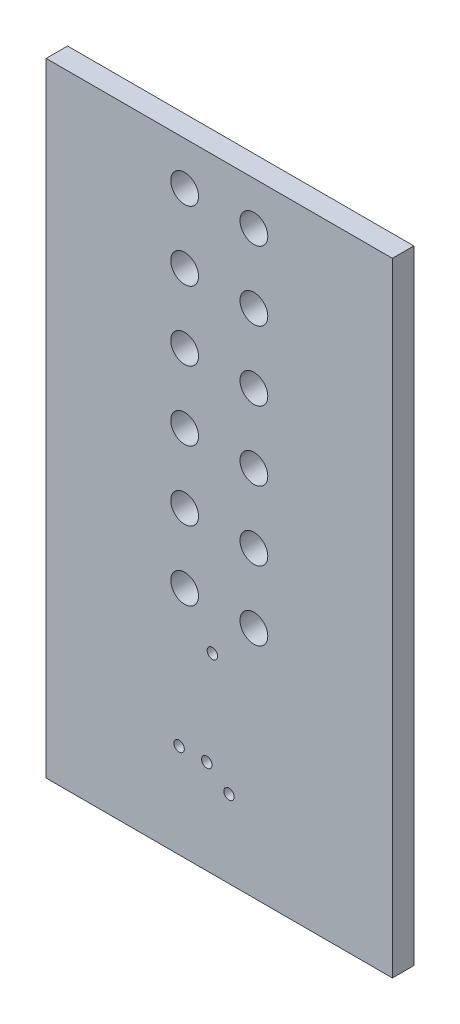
from build123d import *

# Parameters (mm, degrees)
SKETCH1_W           = 12.7
SKETCH1_H           = 22.86
BOARD_OUTLINE_DEPTH = 0.7874
SKETCH2_R           = 0.1905
NPTH_DEPTH          = 27.162752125
SKETCH3_R           = 0.51
PTH_DEPTH           = 27.162752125


with BuildPart() as part:
    # Sketch1 → Board_Outline (new body)
    with BuildSketch(Plane.XY):
        with Locations((6.35, 11.43)):
            Rectangle(SKETCH1_W, SKETCH1_H)
    extrude(amount=BOARD_OUTLINE_DEPTH)

    # Sketch2 → NPTH (cut, through all)
    with BuildSketch(Plane.XY):
        with Locations((4.8768, 3.4544)):
            Circle(SKETCH2_R)
        with Locations((6.096, 7.0104)):
            Circle(SKETCH2_R)
        with Locations((5.8928, 3.4544)):
            Circle(SKETCH2_R)
        with Locations((6.7056, 2.8448)):
            Circle(SKETCH2_R)
    extrude(amount=NPTH_DEPTH, mode=Mode.SUBTRACT)

    # Sketch3 → PTH (cut, through all)
    with BuildSketch(Plane.XY):
        with Locations((7.62, 8.57)):
            Circle(SKETCH3_R)
        with Locations((7.62, 11.11)):
            Circle(SKETCH3_R)
        with Locations((7.62, 13.65)):
            Circle(SKETCH3_R)
        with Locations((7.62, 16.19)):
            Circle(SKETCH3_R)
        with Locations((7.62, 18.73)):
            Circle(SKETCH3_R)
        with Locations((7.62, 21.27)):
            Circle(SKETCH3_R)
        with Locations((5.08, 8.57)):
            Circle(SKETCH3_R)
        with Locations((5.08, 11.11)):
            Circle(SKETCH3_R)
        with Locations((5.08, 13.65)):
            Circle(SKETCH3_R)
        with Locations((5.08, 16.19)):
            Circle(SKETCH3_R)
        with Locations((5.08, 18.73)):
            Circle(SKETCH3_R)
        with Locations((5.08, 21.27)):
            Circle(SKETCH3_R)
    extrude(amount=PTH_DEPTH, mode=Mode.SUBTRACT)


solid = part.part
